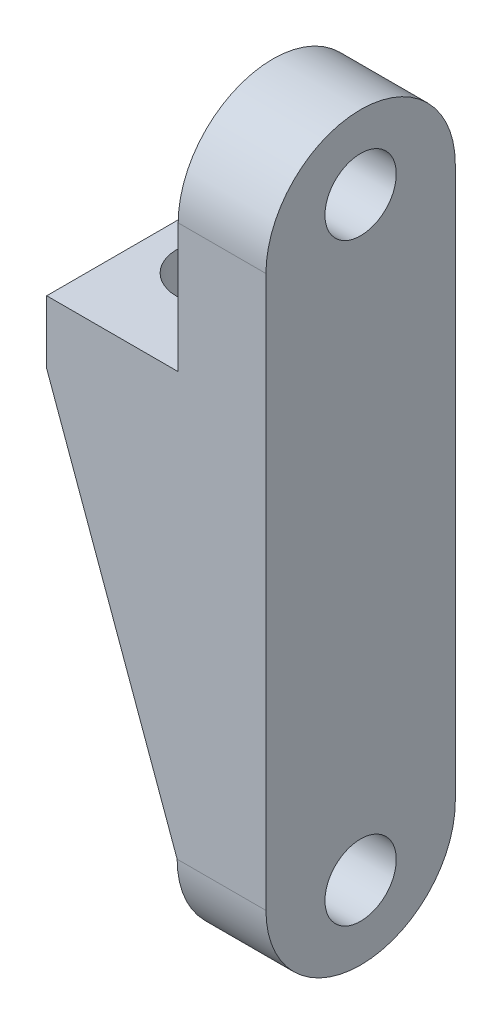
ISO-10303-21;
HEADER;
FILE_DESCRIPTION(('STEP AP214'),'2;1');
FILE_NAME('part.step','',(''),(''),'','','');
FILE_SCHEMA(('AUTOMOTIVE_DESIGN { 1 0 10303 214 1 1 1 1 }'));
ENDSEC;
DATA;
#1=APPLICATION_CONTEXT('core data for automotive mechanical design processes');
#2=APPLICATION_PROTOCOL_DEFINITION('international standard','automotive_design',2000,#1);
#3=PRODUCT_CONTEXT('',#1,'mechanical');
#4=PRODUCT('Part','Part','',(#3));
#5=PRODUCT_RELATED_PRODUCT_CATEGORY('part','',(#4));
#6=PRODUCT_DEFINITION_FORMATION('','',#4);
#7=PRODUCT_DEFINITION_CONTEXT('part definition',#1,'design');
#8=PRODUCT_DEFINITION('design','',#6,#7);
#9=PRODUCT_DEFINITION_SHAPE('','',#8);
#10=(LENGTH_UNIT() NAMED_UNIT(*) SI_UNIT(.MILLI.,.METRE.));
#11=(NAMED_UNIT(*) PLANE_ANGLE_UNIT() SI_UNIT($,.RADIAN.));
#12=(NAMED_UNIT(*) SI_UNIT($,.STERADIAN.) SOLID_ANGLE_UNIT());
#13=UNCERTAINTY_MEASURE_WITH_UNIT(LENGTH_MEASURE(1.E-05),#10,'distance_accuracy_value','');
#14=(GEOMETRIC_REPRESENTATION_CONTEXT(3) GLOBAL_UNCERTAINTY_ASSIGNED_CONTEXT((#13)) GLOBAL_UNIT_ASSIGNED_CONTEXT((#10,
#11,#12)) REPRESENTATION_CONTEXT('',''));
#15=CARTESIAN_POINT('',(0.,0.,0.));
#16=DIRECTION('',(0.,0.,1.));
#17=DIRECTION('',(1.,0.,0.));
#18=AXIS2_PLACEMENT_3D('',#15,#16,#17);
#19=CARTESIAN_POINT('',(-0.0635000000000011,-31.2331099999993,5.715));
#20=DIRECTION('',(1.,0.,0.));
#21=DIRECTION('',(0.,0.,-1.));
#22=AXIS2_PLACEMENT_3D('',#19,#20,#21);
#23=PLANE('',#22);
#24=CARTESIAN_POINT('',(-0.0635000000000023,-26.7881099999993,0.));
#25=DIRECTION('',(-1.,0.,0.));
#26=DIRECTION('',(0.,0.,1.));
#27=AXIS2_PLACEMENT_3D('',#24,#25,#26);
#28=CIRCLE('',#27,2.15264999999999);
#29=CARTESIAN_POINT('',(-0.0635000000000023,-26.7881099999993,2.15265000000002));
#30=VERTEX_POINT('',#29);
#31=EDGE_CURVE('E265',#30,#30,#28,.T.);
#32=ORIENTED_EDGE('',*,*,#31,.F.);
#33=EDGE_LOOP('',(#32));
#34=FACE_BOUND('',#33,.T.);
#35=DIRECTION('',(0.,0.,1.));
#36=VECTOR('',#35,1.);
#37=CARTESIAN_POINT('',(-0.0635000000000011,-25.5181099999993,4.445));
#38=LINE('',#37,#36);
#39=CARTESIAN_POINT('',(-0.0635000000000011,-25.5181099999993,4.445));
#40=VERTEX_POINT('',#39);
#41=CARTESIAN_POINT('',(-0.0635000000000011,-25.5181099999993,5.715));
#42=VERTEX_POINT('',#41);
#43=EDGE_CURVE('E140',#40,#42,#38,.T.);
#44=ORIENTED_EDGE('',*,*,#43,.F.);
#45=DIRECTION('',(0.,1.,0.));
#46=VECTOR('',#45,1.);
#47=CARTESIAN_POINT('',(-0.0635000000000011,-31.2331099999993,4.445));
#48=LINE('',#47,#46);
#49=CARTESIAN_POINT('',(-0.0635000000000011,-3.81,4.445));
#50=VERTEX_POINT('',#49);
#51=EDGE_CURVE('E136',#40,#50,#48,.T.);
#52=ORIENTED_EDGE('',*,*,#51,.T.);
#53=DIRECTION('',(0.,0.,-1.));
#54=VECTOR('',#53,1.);
#55=CARTESIAN_POINT('',(-0.0635000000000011,-3.81,5.715));
#56=LINE('',#55,#54);
#57=CARTESIAN_POINT('',(-0.0635000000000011,-3.81,-4.445));
#58=VERTEX_POINT('',#57);
#59=EDGE_CURVE('E153',#50,#58,#56,.T.);
#60=ORIENTED_EDGE('',*,*,#59,.T.);
#61=DIRECTION('',(0.,-1.,0.));
#62=VECTOR('',#61,1.);
#63=CARTESIAN_POINT('',(-0.0635000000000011,-31.2331099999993,-4.445));
#64=LINE('',#63,#62);
#65=CARTESIAN_POINT('',(-0.0635000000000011,-25.5181099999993,-4.445));
#66=VERTEX_POINT('',#65);
#67=EDGE_CURVE('E67',#58,#66,#64,.T.);
#68=ORIENTED_EDGE('',*,*,#67,.T.);
#69=DIRECTION('',(0.,0.,-1.));
#70=VECTOR('',#69,1.);
#71=CARTESIAN_POINT('',(-0.0635000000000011,-25.5181099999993,-4.445));
#72=LINE('',#71,#70);
#73=CARTESIAN_POINT('',(-0.0635000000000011,-25.5181099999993,-5.715));
#74=VERTEX_POINT('',#73);
#75=EDGE_CURVE('E243',#66,#74,#72,.T.);
#76=ORIENTED_EDGE('',*,*,#75,.T.);
#77=CARTESIAN_POINT('',(-0.0635000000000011,-25.5181099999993,0.));
#78=DIRECTION('',(1.,0.,0.));
#79=DIRECTION('',(0.,0.,-1.));
#80=AXIS2_PLACEMENT_3D('',#77,#78,#79);
#81=CIRCLE('',#80,5.715);
#82=EDGE_CURVE('E178',#74,#42,#81,.F.);
#83=ORIENTED_EDGE('',*,*,#82,.T.);
#84=EDGE_LOOP('',(#44,#52,#60,#68,#76,#83));
#85=FACE_BOUND('',#84,.T.);
#86=ADVANCED_FACE('F43',(#34,#85),#23,.F.);
#87=CARTESIAN_POINT('',(5.29716999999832,7.77875000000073,0.));
#88=DIRECTION('',(-1.,0.,0.));
#89=DIRECTION('',(0.,0.,1.));
#90=AXIS2_PLACEMENT_3D('',#87,#88,#89);
#91=CYLINDRICAL_SURFACE('',#90,5.715);
#92=DIRECTION('',(1.,0.,0.));
#93=VECTOR('',#92,1.);
#94=CARTESIAN_POINT('',(5.29716999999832,7.77875000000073,5.715));
#95=LINE('',#94,#93);
#96=CARTESIAN_POINT('',(5.29716999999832,7.77875000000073,5.715));
#97=VERTEX_POINT('',#96);
#98=CARTESIAN_POINT('',(0.,7.77875000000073,5.715));
#99=VERTEX_POINT('',#98);
#100=EDGE_CURVE('E181',#97,#99,#95,.F.);
#101=ORIENTED_EDGE('',*,*,#100,.F.);
#102=CARTESIAN_POINT('',(5.29716999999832,7.77875000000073,0.));
#103=DIRECTION('',(-1.,0.,0.));
#104=DIRECTION('',(0.,0.,1.));
#105=AXIS2_PLACEMENT_3D('',#102,#103,#104);
#106=CIRCLE('',#105,5.715);
#107=CARTESIAN_POINT('',(5.29716999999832,7.77875000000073,-5.715));
#108=VERTEX_POINT('',#107);
#109=EDGE_CURVE('E52',#108,#97,#106,.F.);
#110=ORIENTED_EDGE('',*,*,#109,.F.);
#111=DIRECTION('',(-1.,0.,0.));
#112=VECTOR('',#111,1.);
#113=CARTESIAN_POINT('',(0.,7.77875000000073,-5.715));
#114=LINE('',#113,#112);
#115=CARTESIAN_POINT('',(0.,7.77875000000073,-5.715));
#116=VERTEX_POINT('',#115);
#117=EDGE_CURVE('E185',#116,#108,#114,.F.);
#118=ORIENTED_EDGE('',*,*,#117,.F.);
#119=CARTESIAN_POINT('',(0.,7.77875000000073,0.));
#120=DIRECTION('',(1.,0.,0.));
#121=DIRECTION('',(0.,0.,-1.));
#122=AXIS2_PLACEMENT_3D('',#119,#120,#121);
#123=CIRCLE('',#122,5.715);
#124=EDGE_CURVE('E11',#99,#116,#123,.F.);
#125=ORIENTED_EDGE('',*,*,#124,.F.);
#126=EDGE_LOOP('',(#101,#110,#118,#125));
#127=FACE_BOUND('',#126,.T.);
#128=ADVANCED_FACE('F45',(#127),#91,.T.);
#129=CARTESIAN_POINT('',(5.29716999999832,-25.5181099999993,0.));
#130=DIRECTION('',(1.,0.,0.));
#131=DIRECTION('',(0.,0.,-1.));
#132=AXIS2_PLACEMENT_3D('',#129,#130,#131);
#133=CYLINDRICAL_SURFACE('',#132,5.715);
#134=DIRECTION('',(1.,0.,0.));
#135=VECTOR('',#134,1.);
#136=CARTESIAN_POINT('',(0.,-25.5181099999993,-5.715));
#137=LINE('',#136,#135);
#138=CARTESIAN_POINT('',(5.29716999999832,-25.5181099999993,-5.715));
#139=VERTEX_POINT('',#138);
#140=EDGE_CURVE('E171',#139,#74,#137,.F.);
#141=ORIENTED_EDGE('',*,*,#140,.F.);
#142=CARTESIAN_POINT('',(5.29716999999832,-25.5181099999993,0.));
#143=DIRECTION('',(-1.,0.,0.));
#144=DIRECTION('',(0.,0.,1.));
#145=AXIS2_PLACEMENT_3D('',#142,#143,#144);
#146=CIRCLE('',#145,5.715);
#147=CARTESIAN_POINT('',(5.29716999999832,-25.5181099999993,5.715));
#148=VERTEX_POINT('',#147);
#149=EDGE_CURVE('E176',#148,#139,#146,.F.);
#150=ORIENTED_EDGE('',*,*,#149,.F.);
#151=DIRECTION('',(-1.,0.,0.));
#152=VECTOR('',#151,1.);
#153=CARTESIAN_POINT('',(5.29716999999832,-25.5181099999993,5.715));
#154=LINE('',#153,#152);
#155=EDGE_CURVE('E173',#42,#148,#154,.F.);
#156=ORIENTED_EDGE('',*,*,#155,.F.);
#157=ORIENTED_EDGE('',*,*,#82,.F.);
#158=EDGE_LOOP('',(#141,#150,#156,#157));
#159=FACE_BOUND('',#158,.T.);
#160=ADVANCED_FACE('F299',(#159),#133,.T.);
#161=CARTESIAN_POINT('',(0.,0.,5.715));
#162=DIRECTION('',(1.,0.,0.));
#163=DIRECTION('',(0.,0.,-1.));
#164=AXIS2_PLACEMENT_3D('',#161,#162,#163);
#165=PLANE('',#164);
#166=CARTESIAN_POINT('',(0.,9.04875000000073,0.));
#167=DIRECTION('',(1.,0.,0.));
#168=DIRECTION('',(0.,0.,-1.));
#169=AXIS2_PLACEMENT_3D('',#166,#167,#168);
#170=CIRCLE('',#169,2.15264999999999);
#171=CARTESIAN_POINT('',(0.,9.04875000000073,-2.15265000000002));
#172=VERTEX_POINT('',#171);
#173=EDGE_CURVE('E219',#172,#172,#170,.T.);
#174=ORIENTED_EDGE('',*,*,#173,.T.);
#175=EDGE_LOOP('',(#174));
#176=FACE_BOUND('',#175,.T.);
#177=DIRECTION('',(0.,-1.,0.));
#178=VECTOR('',#177,1.);
#179=CARTESIAN_POINT('',(0.,0.,5.715));
#180=LINE('',#179,#178);
#181=CARTESIAN_POINT('',(0.,0.,5.715));
#182=VERTEX_POINT('',#181);
#183=EDGE_CURVE('E204',#99,#182,#180,.T.);
#184=ORIENTED_EDGE('',*,*,#183,.F.);
#185=ORIENTED_EDGE('',*,*,#124,.T.);
#186=DIRECTION('',(0.,-1.,0.));
#187=VECTOR('',#186,1.);
#188=CARTESIAN_POINT('',(0.,0.,-5.715));
#189=LINE('',#188,#187);
#190=CARTESIAN_POINT('',(0.,0.,-5.715));
#191=VERTEX_POINT('',#190);
#192=EDGE_CURVE('E224',#116,#191,#189,.T.);
#193=ORIENTED_EDGE('',*,*,#192,.T.);
#194=DIRECTION('',(0.,0.,-1.));
#195=VECTOR('',#194,1.);
#196=CARTESIAN_POINT('',(0.,0.,5.715));
#197=LINE('',#196,#195);
#198=EDGE_CURVE('E168',#182,#191,#197,.T.);
#199=ORIENTED_EDGE('',*,*,#198,.F.);
#200=EDGE_LOOP('',(#184,#185,#193,#199));
#201=FACE_BOUND('',#200,.T.);
#202=ADVANCED_FACE('F208',(#176,#201),#165,.F.);
#203=CARTESIAN_POINT('',(0.,0.,5.715));
#204=DIRECTION('',(0.,-1.,0.));
#205=DIRECTION('',(1.,0.,0.));
#206=AXIS2_PLACEMENT_3D('',#203,#204,#205);
#207=PLANE('',#206);
#208=CARTESIAN_POINT('',(-3.96875000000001,0.,-0.634999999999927));
#209=DIRECTION('',(0.,-1.,0.));
#210=DIRECTION('',(1.,0.,0.));
#211=AXIS2_PLACEMENT_3D('',#208,#209,#210);
#212=CIRCLE('',#211,2.45744999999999);
#213=CARTESIAN_POINT('',(-1.51130000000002,0.,-0.634999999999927));
#214=VERTEX_POINT('',#213);
#215=EDGE_CURVE('E261',#214,#214,#212,.T.);
#216=ORIENTED_EDGE('',*,*,#215,.T.);
#217=EDGE_LOOP('',(#216));
#218=FACE_BOUND('',#217,.T.);
#219=DIRECTION('',(-1.,0.,0.));
#220=VECTOR('',#219,1.);
#221=CARTESIAN_POINT('',(0.,0.,-5.715));
#222=LINE('',#221,#220);
#223=CARTESIAN_POINT('',(-7.9375,0.,-5.715));
#224=VERTEX_POINT('',#223);
#225=EDGE_CURVE('E227',#191,#224,#222,.T.);
#226=ORIENTED_EDGE('',*,*,#225,.T.);
#227=DIRECTION('',(0.,0.,-1.));
#228=VECTOR('',#227,1.);
#229=CARTESIAN_POINT('',(-7.9375,0.,5.715));
#230=LINE('',#229,#228);
#231=CARTESIAN_POINT('',(-7.9375,0.,5.715));
#232=VERTEX_POINT('',#231);
#233=EDGE_CURVE('E149',#232,#224,#230,.T.);
#234=ORIENTED_EDGE('',*,*,#233,.F.);
#235=DIRECTION('',(-1.,0.,0.));
#236=VECTOR('',#235,1.);
#237=CARTESIAN_POINT('',(0.,0.,5.715));
#238=LINE('',#237,#236);
#239=EDGE_CURVE('E211',#182,#232,#238,.T.);
#240=ORIENTED_EDGE('',*,*,#239,.F.);
#241=ORIENTED_EDGE('',*,*,#198,.T.);
#242=EDGE_LOOP('',(#226,#234,#240,#241));
#243=FACE_BOUND('',#242,.T.);
#244=ADVANCED_FACE('F308',(#218,#243),#207,.F.);
#245=CARTESIAN_POINT('',(-7.9375,0.,5.715));
#246=DIRECTION('',(1.,0.,0.));
#247=DIRECTION('',(0.,0.,-1.));
#248=AXIS2_PLACEMENT_3D('',#245,#246,#247);
#249=PLANE('',#248);
#250=DIRECTION('',(0.,0.,-1.));
#251=VECTOR('',#250,1.);
#252=CARTESIAN_POINT('',(-7.9375,-3.81,5.715));
#253=LINE('',#252,#251);
#254=CARTESIAN_POINT('',(-7.9375,-3.81,4.445));
#255=VERTEX_POINT('',#254);
#256=CARTESIAN_POINT('',(-7.9375,-3.81,-4.445));
#257=VERTEX_POINT('',#256);
#258=EDGE_CURVE('E59',#255,#257,#253,.T.);
#259=ORIENTED_EDGE('',*,*,#258,.F.);
#260=CARTESIAN_POINT('',(-7.9375,-3.81,5.715));
#261=VERTEX_POINT('',#260);
#262=EDGE_CURVE('E144',#261,#255,#253,.T.);
#263=ORIENTED_EDGE('',*,*,#262,.F.);
#264=DIRECTION('',(0.,-1.,0.));
#265=VECTOR('',#264,1.);
#266=CARTESIAN_POINT('',(-7.9375,0.,5.715));
#267=LINE('',#266,#265);
#268=EDGE_CURVE('E214',#232,#261,#267,.T.);
#269=ORIENTED_EDGE('',*,*,#268,.F.);
#270=ORIENTED_EDGE('',*,*,#233,.T.);
#271=DIRECTION('',(0.,-1.,0.));
#272=VECTOR('',#271,1.);
#273=CARTESIAN_POINT('',(-7.9375,0.,-5.715));
#274=LINE('',#273,#272);
#275=CARTESIAN_POINT('',(-7.9375,-3.81,-5.715));
#276=VERTEX_POINT('',#275);
#277=EDGE_CURVE('E217',#224,#276,#274,.T.);
#278=ORIENTED_EDGE('',*,*,#277,.T.);
#279=DIRECTION('',(0.,0.,-1.));
#280=VECTOR('',#279,1.);
#281=CARTESIAN_POINT('',(-7.9375,-3.81,-4.445));
#282=LINE('',#281,#280);
#283=EDGE_CURVE('E159',#257,#276,#282,.T.);
#284=ORIENTED_EDGE('',*,*,#283,.F.);
#285=EDGE_LOOP('',(#259,#263,#269,#270,#278,#284));
#286=FACE_BOUND('',#285,.T.);
#287=ADVANCED_FACE('F157',(#286),#249,.F.);
#288=CARTESIAN_POINT('',(-7.9375,-3.81,5.715));
#289=DIRECTION('',(0.,1.,0.));
#290=DIRECTION('',(-1.,0.,0.));
#291=AXIS2_PLACEMENT_3D('',#288,#289,#290);
#292=PLANE('',#291);
#293=CARTESIAN_POINT('',(-3.96875000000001,-3.81,-0.634999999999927));
#294=DIRECTION('',(0.,-1.,0.));
#295=DIRECTION('',(0.,0.,-1.));
#296=AXIS2_PLACEMENT_3D('',#293,#294,#295);
#297=CIRCLE('',#296,2.45744999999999);
#298=CARTESIAN_POINT('',(-3.96875000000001,-3.81,-3.09244999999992));
#299=VERTEX_POINT('',#298);
#300=EDGE_CURVE('E257',#299,#299,#297,.T.);
#301=ORIENTED_EDGE('',*,*,#300,.F.);
#302=EDGE_LOOP('',(#301));
#303=FACE_BOUND('',#302,.T.);
#304=ORIENTED_EDGE('',*,*,#59,.F.);
#305=DIRECTION('',(-1.,0.,0.));
#306=VECTOR('',#305,1.);
#307=CARTESIAN_POINT('',(-7.9375,-3.81,4.445));
#308=LINE('',#307,#306);
#309=EDGE_CURVE('E134',#50,#255,#308,.T.);
#310=ORIENTED_EDGE('',*,*,#309,.T.);
#311=ORIENTED_EDGE('',*,*,#258,.T.);
#312=DIRECTION('',(1.,0.,0.));
#313=VECTOR('',#312,1.);
#314=CARTESIAN_POINT('',(-7.9375,-3.81,-4.445));
#315=LINE('',#314,#313);
#316=EDGE_CURVE('E254',#257,#58,#315,.T.);
#317=ORIENTED_EDGE('',*,*,#316,.T.);
#318=EDGE_LOOP('',(#304,#310,#311,#317));
#319=FACE_BOUND('',#318,.T.);
#320=ADVANCED_FACE('F152',(#303,#319),#292,.F.);
#321=CARTESIAN_POINT('',(5.29716999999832,-31.2331099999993,5.715));
#322=DIRECTION('',(-1.,0.,0.));
#323=DIRECTION('',(0.,0.,1.));
#324=AXIS2_PLACEMENT_3D('',#321,#322,#323);
#325=PLANE('',#324);
#326=ORIENTED_EDGE('',*,*,#109,.T.);
#327=DIRECTION('',(0.,1.,0.));
#328=VECTOR('',#327,1.);
#329=CARTESIAN_POINT('',(5.29716999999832,-31.2331099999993,5.715));
#330=LINE('',#329,#328);
#331=EDGE_CURVE('E162',#148,#97,#330,.T.);
#332=ORIENTED_EDGE('',*,*,#331,.F.);
#333=ORIENTED_EDGE('',*,*,#149,.T.);
#334=DIRECTION('',(0.,1.,0.));
#335=VECTOR('',#334,1.);
#336=CARTESIAN_POINT('',(5.29716999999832,-31.2331099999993,-5.715));
#337=LINE('',#336,#335);
#338=EDGE_CURVE('E198',#139,#108,#337,.T.);
#339=ORIENTED_EDGE('',*,*,#338,.T.);
#340=EDGE_LOOP('',(#326,#332,#333,#339));
#341=FACE_BOUND('',#340,.T.);
#342=CARTESIAN_POINT('',(5.29716999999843,9.04875000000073,0.));
#343=DIRECTION('',(-1.,0.,0.));
#344=DIRECTION('',(0.,0.,1.));
#345=AXIS2_PLACEMENT_3D('',#342,#343,#344);
#346=CIRCLE('',#345,2.15265);
#347=CARTESIAN_POINT('',(5.29716999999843,9.04875000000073,2.15264999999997));
#348=VERTEX_POINT('',#347);
#349=EDGE_CURVE('E270',#348,#348,#346,.T.);
#350=ORIENTED_EDGE('',*,*,#349,.T.);
#351=EDGE_LOOP('',(#350));
#352=FACE_BOUND('',#351,.T.);
#353=CARTESIAN_POINT('',(5.29716999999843,-26.7881099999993,0.));
#354=DIRECTION('',(-1.,0.,0.));
#355=DIRECTION('',(0.,0.,1.));
#356=AXIS2_PLACEMENT_3D('',#353,#354,#355);
#357=CIRCLE('',#356,2.15265);
#358=CARTESIAN_POINT('',(5.29716999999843,-26.7881099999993,2.15265000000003));
#359=VERTEX_POINT('',#358);
#360=EDGE_CURVE('E268',#359,#359,#357,.T.);
#361=ORIENTED_EDGE('',*,*,#360,.T.);
#362=EDGE_LOOP('',(#361));
#363=FACE_BOUND('',#362,.T.);
#364=ADVANCED_FACE('F195',(#341,#352,#363),#325,.F.);
#365=CARTESIAN_POINT('',(0.,0.,5.715));
#366=DIRECTION('',(0.,0.,1.));
#367=DIRECTION('',(1.,0.,0.));
#368=AXIS2_PLACEMENT_3D('',#365,#366,#367);
#369=PLANE('',#368);
#370=ORIENTED_EDGE('',*,*,#331,.T.);
#371=ORIENTED_EDGE('',*,*,#100,.T.);
#372=ORIENTED_EDGE('',*,*,#183,.T.);
#373=ORIENTED_EDGE('',*,*,#239,.T.);
#374=ORIENTED_EDGE('',*,*,#268,.T.);
#375=DIRECTION('',(-0.340983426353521,0.940069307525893,0.));
#376=VECTOR('',#375,1.);
#377=CARTESIAN_POINT('',(-7.9375,-3.81,5.715));
#378=LINE('',#377,#376);
#379=EDGE_CURVE('E141',#42,#261,#378,.T.);
#380=ORIENTED_EDGE('',*,*,#379,.F.);
#381=ORIENTED_EDGE('',*,*,#155,.T.);
#382=EDGE_LOOP('',(#370,#371,#372,#373,#374,#380,#381));
#383=FACE_BOUND('',#382,.T.);
#384=ADVANCED_FACE('F203',(#383),#369,.T.);
#385=CARTESIAN_POINT('',(0.,0.,-5.715));
#386=DIRECTION('',(0.,0.,1.));
#387=DIRECTION('',(1.,0.,0.));
#388=AXIS2_PLACEMENT_3D('',#385,#386,#387);
#389=PLANE('',#388);
#390=ORIENTED_EDGE('',*,*,#117,.T.);
#391=ORIENTED_EDGE('',*,*,#338,.F.);
#392=ORIENTED_EDGE('',*,*,#140,.T.);
#393=DIRECTION('',(-0.340983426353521,0.940069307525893,0.));
#394=VECTOR('',#393,1.);
#395=CARTESIAN_POINT('',(-7.9375,-3.81,-5.715));
#396=LINE('',#395,#394);
#397=EDGE_CURVE('E155',#74,#276,#396,.T.);
#398=ORIENTED_EDGE('',*,*,#397,.T.);
#399=ORIENTED_EDGE('',*,*,#277,.F.);
#400=ORIENTED_EDGE('',*,*,#225,.F.);
#401=ORIENTED_EDGE('',*,*,#192,.F.);
#402=EDGE_LOOP('',(#390,#391,#392,#398,#399,#400,#401));
#403=FACE_BOUND('',#402,.T.);
#404=ADVANCED_FACE('F245',(#403),#389,.F.);
#405=CARTESIAN_POINT('',(-0.0635000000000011,9.04875000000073,0.));
#406=DIRECTION('',(-1.,0.,0.));
#407=DIRECTION('',(0.,0.,1.));
#408=AXIS2_PLACEMENT_3D('',#405,#406,#407);
#409=CYLINDRICAL_SURFACE('',#408,2.15264999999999);
#410=ORIENTED_EDGE('',*,*,#349,.F.);
#411=EDGE_LOOP('',(#410));
#412=FACE_BOUND('',#411,.T.);
#413=ORIENTED_EDGE('',*,*,#173,.F.);
#414=EDGE_LOOP('',(#413));
#415=FACE_BOUND('',#414,.T.);
#416=ADVANCED_FACE('F279',(#412,#415),#409,.F.);
#417=CARTESIAN_POINT('',(-0.0635000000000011,-26.7881099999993,0.));
#418=DIRECTION('',(-1.,0.,0.));
#419=DIRECTION('',(0.,0.,1.));
#420=AXIS2_PLACEMENT_3D('',#417,#418,#419);
#421=CYLINDRICAL_SURFACE('',#420,2.15264999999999);
#422=ORIENTED_EDGE('',*,*,#360,.F.);
#423=EDGE_LOOP('',(#422));
#424=FACE_BOUND('',#423,.T.);
#425=ORIENTED_EDGE('',*,*,#31,.T.);
#426=EDGE_LOOP('',(#425));
#427=FACE_BOUND('',#426,.T.);
#428=ADVANCED_FACE('F281',(#424,#427),#421,.F.);
#429=CARTESIAN_POINT('',(-3.96875000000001,-3.81,-0.634999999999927));
#430=DIRECTION('',(0.,-1.,0.));
#431=DIRECTION('',(0.,0.,-1.));
#432=AXIS2_PLACEMENT_3D('',#429,#430,#431);
#433=CYLINDRICAL_SURFACE('',#432,2.45744999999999);
#434=ORIENTED_EDGE('',*,*,#300,.T.);
#435=EDGE_LOOP('',(#434));
#436=FACE_BOUND('',#435,.T.);
#437=ORIENTED_EDGE('',*,*,#215,.F.);
#438=EDGE_LOOP('',(#437));
#439=FACE_BOUND('',#438,.T.);
#440=ADVANCED_FACE('F288',(#436,#439),#433,.F.);
#441=CARTESIAN_POINT('',(0.,0.,-4.445));
#442=DIRECTION('',(0.,0.,1.));
#443=DIRECTION('',(1.,0.,0.));
#444=AXIS2_PLACEMENT_3D('',#441,#442,#443);
#445=PLANE('',#444);
#446=ORIENTED_EDGE('',*,*,#316,.F.);
#447=DIRECTION('',(-0.340983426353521,0.940069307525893,0.));
#448=VECTOR('',#447,1.);
#449=CARTESIAN_POINT('',(-7.9375,-3.81,-4.445));
#450=LINE('',#449,#448);
#451=EDGE_CURVE('E242',#66,#257,#450,.T.);
#452=ORIENTED_EDGE('',*,*,#451,.F.);
#453=ORIENTED_EDGE('',*,*,#67,.F.);
#454=EDGE_LOOP('',(#446,#452,#453));
#455=FACE_BOUND('',#454,.T.);
#456=ADVANCED_FACE('F323',(#455),#445,.T.);
#457=CARTESIAN_POINT('',(-7.9375,-3.81,-4.445));
#458=DIRECTION('',(-0.940069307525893,-0.340983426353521,0.));
#459=DIRECTION('',(0.340983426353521,-0.940069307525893,0.));
#460=AXIS2_PLACEMENT_3D('',#457,#458,#459);
#461=PLANE('',#460);
#462=ORIENTED_EDGE('',*,*,#397,.F.);
#463=ORIENTED_EDGE('',*,*,#75,.F.);
#464=ORIENTED_EDGE('',*,*,#451,.T.);
#465=ORIENTED_EDGE('',*,*,#283,.T.);
#466=EDGE_LOOP('',(#462,#463,#464,#465));
#467=FACE_BOUND('',#466,.T.);
#468=ADVANCED_FACE('F240',(#467),#461,.T.);
#469=CARTESIAN_POINT('',(0.,0.,4.445));
#470=DIRECTION('',(0.,0.,-1.));
#471=DIRECTION('',(1.,0.,0.));
#472=AXIS2_PLACEMENT_3D('',#469,#470,#471);
#473=PLANE('',#472);
#474=ORIENTED_EDGE('',*,*,#309,.F.);
#475=ORIENTED_EDGE('',*,*,#51,.F.);
#476=DIRECTION('',(-0.340983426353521,0.940069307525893,0.));
#477=VECTOR('',#476,1.);
#478=CARTESIAN_POINT('',(-7.9375,-3.81,4.445));
#479=LINE('',#478,#477);
#480=EDGE_CURVE('E131',#40,#255,#479,.T.);
#481=ORIENTED_EDGE('',*,*,#480,.T.);
#482=EDGE_LOOP('',(#474,#475,#481));
#483=FACE_BOUND('',#482,.T.);
#484=ADVANCED_FACE('F133',(#483),#473,.T.);
#485=CARTESIAN_POINT('',(-7.9375,-3.81,4.445));
#486=DIRECTION('',(0.940069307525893,0.340983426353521,0.));
#487=DIRECTION('',(-0.340983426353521,0.940069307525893,0.));
#488=AXIS2_PLACEMENT_3D('',#485,#486,#487);
#489=PLANE('',#488);
#490=ORIENTED_EDGE('',*,*,#379,.T.);
#491=ORIENTED_EDGE('',*,*,#262,.T.);
#492=ORIENTED_EDGE('',*,*,#480,.F.);
#493=ORIENTED_EDGE('',*,*,#43,.T.);
#494=EDGE_LOOP('',(#490,#491,#492,#493));
#495=FACE_BOUND('',#494,.T.);
#496=ADVANCED_FACE('F145',(#495),#489,.F.);
#497=CLOSED_SHELL('',(#86,#128,#160,#202,#244,#287,#320,#364,#384,#404,#416,#428,#440,#456,#468,
#484,#496));
#498=MANIFOLD_SOLID_BREP('B2',#497);
#499=ADVANCED_BREP_SHAPE_REPRESENTATION('',(#18,#498),#14);
#500=SHAPE_DEFINITION_REPRESENTATION(#9,#499);
ENDSEC;
END-ISO-10303-21;
